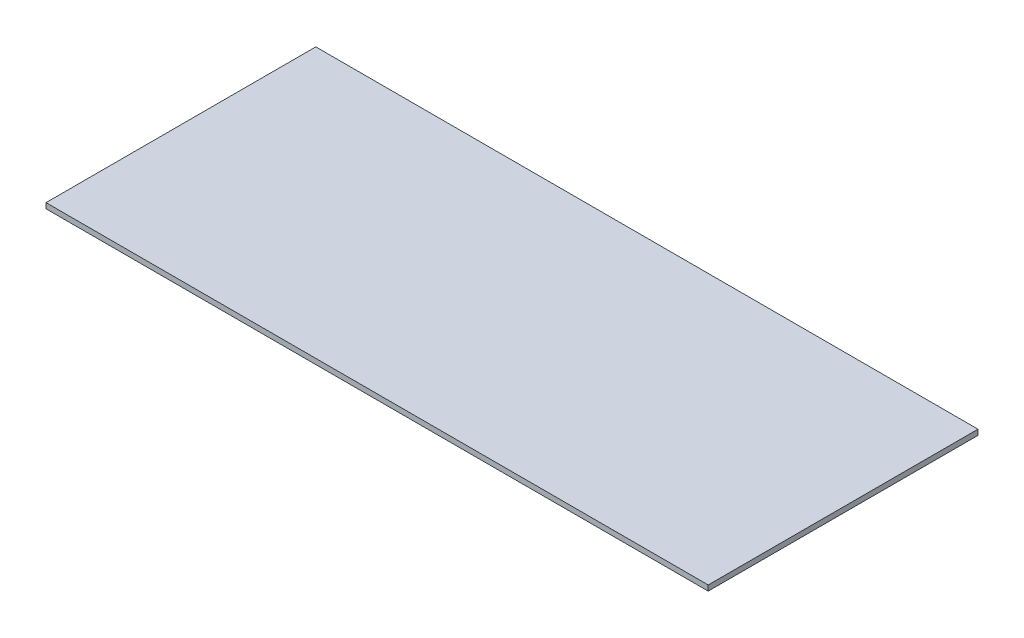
from build123d import *

# Parameters (mm, degrees)
SKETCH1_W           = 685.8
SKETCH1_H           = 279.4
BOSS_EXTRUDE1_DEPTH = 5.55625


with BuildPart() as part:
    # Sketch1 → Boss-Extrude1 (new body)
    with BuildSketch(Plane(origin=(0, 0, 0), x_dir=(1, 0, 0), z_dir=(0, 1, 0))):
        Rectangle(SKETCH1_W, SKETCH1_H)
    extrude(amount=BOSS_EXTRUDE1_DEPTH)


solid = part.part
